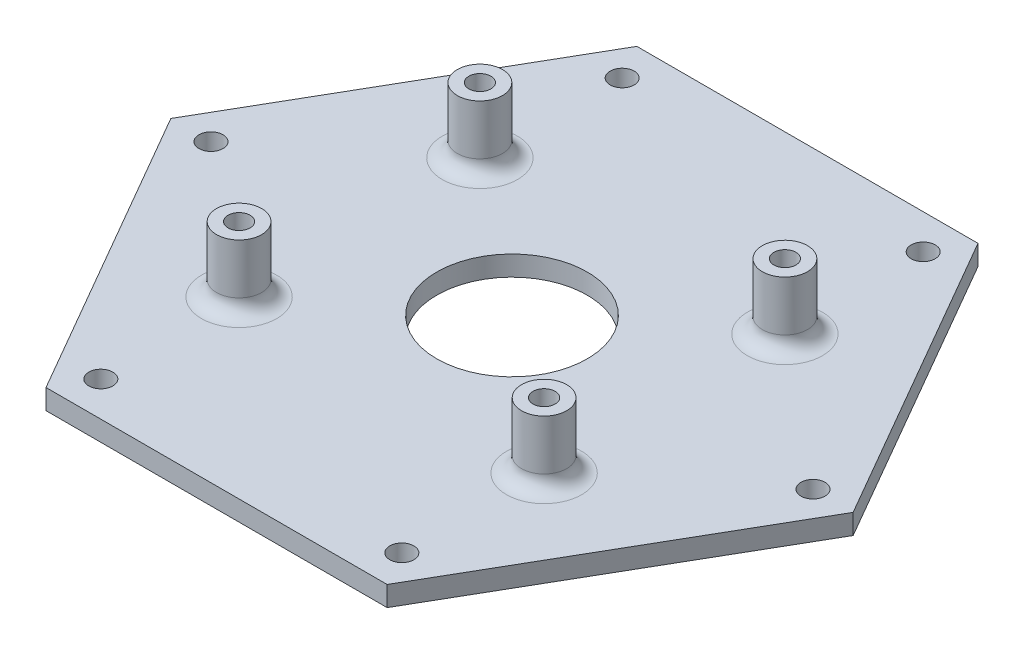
from build123d import *

# Parameters (mm, degrees)
BOSS_EXTRUDE1_DEPTH = 2
SKETCH2_R           = 2.25
BOSS_EXTRUDE2_DEPTH = 6.5
SKETCH3_R           = 1.1
CUT_EXTRUDE1_DEPTH  = 46.773900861
SKETCH4_R           = 7.5
CUT_EXTRUDE2_DEPTH  = 46.44502173
SKETCH6_R           = 1.2
CUT_EXTRUDE3_DEPTH  = 46.44502173
CIRPATTERN1_COUNT   = 6
FILLET2_R           = 1.5


with BuildPart() as part:
    # Sketch1 → Boss-Extrude1 (new body)
    with BuildSketch(Plane(origin=(0, 0, 0), x_dir=(1, 0, 0), z_dir=(0, 1, 0))):
        Polygon((34, 0), (17, 29.444863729), (-17, 29.444863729), (-34, 0), (-17, -29.444863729), (17, -29.444863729), align=None)
    extrude(amount=BOSS_EXTRUDE1_DEPTH)

    # Sketch2 → Boss-Extrude2 (add)
    with BuildSketch(Plane(origin=(0, 2, 0), x_dir=(1, 0, 0), z_dir=(0, 1, 0))):
        with Locations(Location((-15.2, 12, 0), (0, 0, 90))):
            Circle(SKETCH2_R)
        with Locations(Location((15.2, 12, 0), (0, 0, 90))):
            Circle(SKETCH2_R)
        with Locations(Location((-15.2, -12, 0), (0, 0, 90))):
            Circle(SKETCH2_R)
        with Locations(Location((15.2, -12, 0), (0, 0, 90))):
            Circle(SKETCH2_R)
    extrude(amount=BOSS_EXTRUDE2_DEPTH)

    # Sketch3 → Cut-Extrude1 (cut, through all)
    with BuildSketch(Plane(origin=(0, 8.5, 0), x_dir=(1, 0, 0), z_dir=(0, 1, 0))):
        with Locations(Location((-15.2, 12, 0), (0, 0, 270))):
            Circle(SKETCH3_R)
        with Locations(Location((15.2, 12, 0), (0, 0, 270))):
            Circle(SKETCH3_R)
        with Locations(Location((15.2, -12, 0), (0, 0, 270))):
            Circle(SKETCH3_R)
        with Locations(Location((-15.2, -12, 0), (0, 0, 270))):
            Circle(SKETCH3_R)
    extrude(amount=-CUT_EXTRUDE1_DEPTH, mode=Mode.SUBTRACT)

    # Sketch4 → Cut-Extrude2 (cut, through all)
    with BuildSketch(Plane(origin=(0, 2, 0), x_dir=(1, 0, 0), z_dir=(0, 1, 0))):
        with Locations(Location((0, 0, 0), (0, 0, 270))):
            Circle(SKETCH4_R)
    extrude(amount=-CUT_EXTRUDE2_DEPTH, mode=Mode.SUBTRACT)

    # Sketch6 → Cut-Extrude3 (cut, through all)
    with BuildSketch(Plane(origin=(0, 2, 0), x_dir=(1, 0, 0), z_dir=(0, 1, 0))):
        with Locations(Location((-30, 0, 0), (0, 0, 270))):
            Circle(SKETCH6_R)
    cut_extrude3 = extrude(amount=-CUT_EXTRUDE3_DEPTH, mode=Mode.SUBTRACT)

    # CirPattern1: Cut-Extrude3 ×6 about axis
    cirpattern1_axis = Axis((0, 0, 0), (0, 1, 0))
    for i in range(1, CIRPATTERN1_COUNT):
        add(cut_extrude3.rotate(cirpattern1_axis, i * 360 / CIRPATTERN1_COUNT), mode=Mode.SUBTRACT)

    # Fillet2
    fillet2_edges = [part.edges().sort_by_distance(p)[0] for p in [
        (-15.2, 2, -9.75),
        (15.2, 2, -9.75),
        (-15.2, 2, 14.25),
        (15.2, 2, 14.25),
    ]]
    fillet(fillet2_edges, radius=FILLET2_R)


solid = part.part
